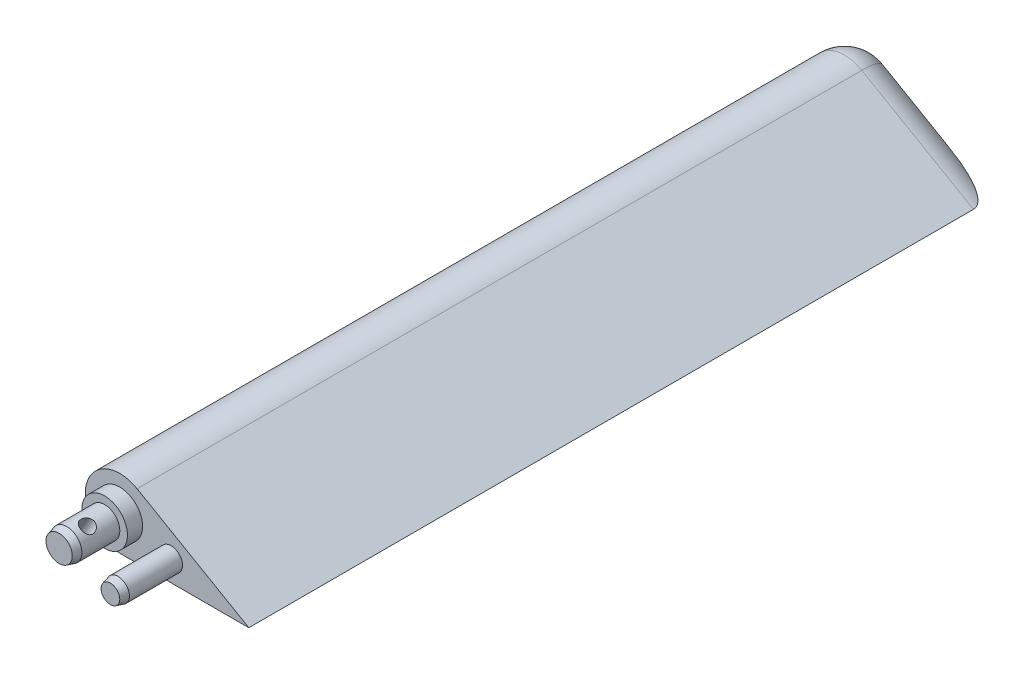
from build123d import *
from OCP.BRepFilletAPI import BRepFilletAPI_MakeChamfer

# Parameters (mm, degrees)
EXTRUSION1_DEPTH = 500
ESQUISSE4_R      = 15
EXTRUSION3_DEPTH = 10
ESQUISSE17_R     = 10
EXTRUSION5_DEPTH = 30
ESQUISSE5_R      = 7.5
EXTRUSION4_DEPTH = 40
D_GAGEMENT_M81_D = 9
CONG_1_R         = 22.5
CHANFREIN1_SIZE  = 5
CHANFREIN1_SIZE2 = 1.339745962


with BuildPart() as part:
    # Esquisse1 → Extrusion1 (new body)
    with BuildSketch(Plane.XY):
        with BuildLine():
            Line((-38.282150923, 0), (46.717849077, 0))
            Line((46.717849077, 0), (-26.894310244, 42.5))
            ThreePointArc((-26.894310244, 42.5), (-60.281769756, 28.670461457), (-38.282150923, 0))
        make_face()
    extrude(amount=EXTRUSION1_DEPTH)

    # Esquisse4 → Extrusion3 (add)
    with BuildSketch(Plane.XY.offset(500)):
        with Locations((-38.282150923, 22.775681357)):
            Circle(ESQUISSE4_R)
    extrude(amount=EXTRUSION3_DEPTH)

    # Esquisse17 → Extrusion5 (add)
    with BuildSketch(Plane.XY.offset(510)):
        with Locations((-38.282150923, 22.775681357)):
            Circle(ESQUISSE17_R)
    extrude(amount=EXTRUSION5_DEPTH)

    # Esquisse5 → Extrusion4 (add)
    with BuildSketch(Plane.XY.offset(500)):
        with Locations((-4.474747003, 13.717014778)):
            Circle(ESQUISSE5_R)
    extrude(amount=EXTRUSION4_DEPTH)

    # D_gagement M81 (through all)
    with Locations(Plane(origin=(11.679462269, 20.229422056, 0), x_dir=(-0.866025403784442, 0.49999999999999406, 0), z_dir=(0.49999999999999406, 0.866025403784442, 0))):
        with Locations((44.541155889, 526.17273664)):
            Hole(D_GAGEMENT_M81_D / 2)

    # Cong_1
    cong_1_edges = [part.edges().sort_by_distance(p)[0] for p in [
        (9.911769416, 21.25, 0),
        (4.217849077, 0, 0),
        (-60.281769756, 28.670461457, 0),
    ]]
    fillet(cong_1_edges, radius=CONG_1_R)

    # Chanfrein1: one chamfer whose edges measure the first distance from different faces: ONE call of the kernel's chamfer builder (chamfer() names one face for all edges)
    chanfrein1_edges_1 = [part.edges().sort_by_distance(p)[0] for p in [
        (-48.282150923, 22.775681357, 540),
    ]]
    chanfrein1_side_1 = [part.faces().sort_by_distance(p)[0] for p in [
        (-48.282150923, 22.775681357, 525),
    ]]
    chanfrein1_edges_2 = [part.edges().sort_by_distance(p)[0] for p in [
        (-11.974747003, 13.717014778, 540),
    ]]
    chanfrein1_side_2 = [part.faces().sort_by_distance(p)[0] for p in [
        (-11.974747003, 13.717014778, 520),
    ]]
    chanfrein1 = BRepFilletAPI_MakeChamfer(part.part.solid().wrapped)
    for e in chanfrein1_edges_1:
        chanfrein1.Add(CHANFREIN1_SIZE, CHANFREIN1_SIZE2, e.wrapped, chanfrein1_side_1[0].wrapped)  # the first distance lies on this face
    for e in chanfrein1_edges_2:
        chanfrein1.Add(CHANFREIN1_SIZE, CHANFREIN1_SIZE2, e.wrapped, chanfrein1_side_2[0].wrapped)  # the first distance lies on this face
    add(Compound.cast(chanfrein1.Shape()), mode=Mode.REPLACE)


solid = part.part
